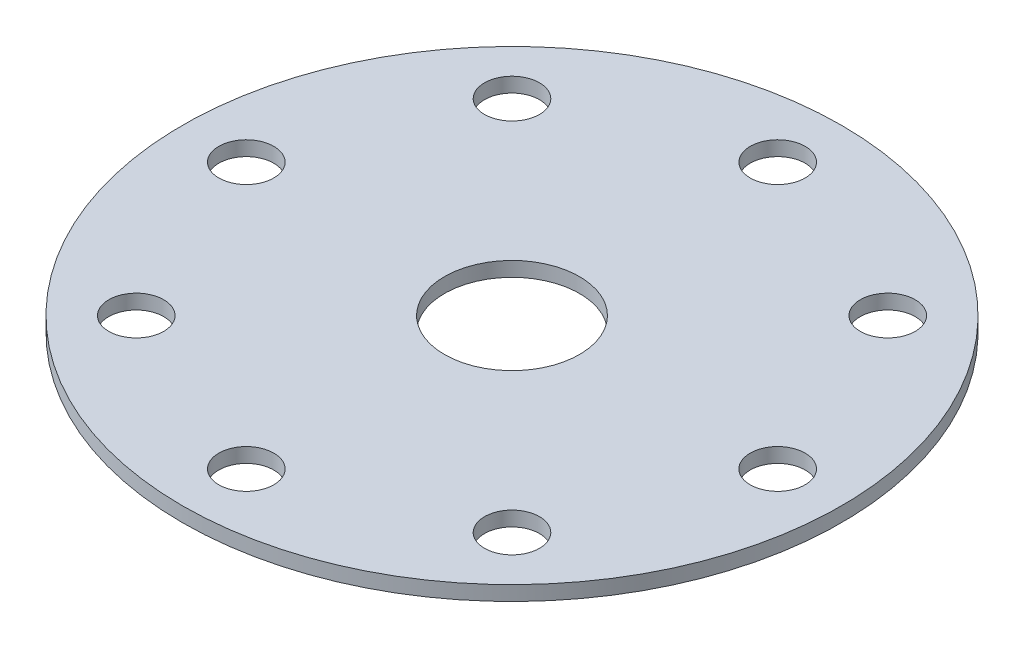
ISO-10303-21;
HEADER;
FILE_DESCRIPTION(('STEP AP214'),'2;1');
FILE_NAME('part.step','',(''),(''),'','','');
FILE_SCHEMA(('AUTOMOTIVE_DESIGN { 1 0 10303 214 1 1 1 1 }'));
ENDSEC;
DATA;
#1=APPLICATION_CONTEXT('core data for automotive mechanical design processes');
#2=APPLICATION_PROTOCOL_DEFINITION('international standard','automotive_design',2000,#1);
#3=PRODUCT_CONTEXT('',#1,'mechanical');
#4=PRODUCT('Part','Part','',(#3));
#5=PRODUCT_RELATED_PRODUCT_CATEGORY('part','',(#4));
#6=PRODUCT_DEFINITION_FORMATION('','',#4);
#7=PRODUCT_DEFINITION_CONTEXT('part definition',#1,'design');
#8=PRODUCT_DEFINITION('design','',#6,#7);
#9=PRODUCT_DEFINITION_SHAPE('','',#8);
#10=(LENGTH_UNIT() NAMED_UNIT(*) SI_UNIT(.MILLI.,.METRE.));
#11=(NAMED_UNIT(*) PLANE_ANGLE_UNIT() SI_UNIT($,.RADIAN.));
#12=(NAMED_UNIT(*) SI_UNIT($,.STERADIAN.) SOLID_ANGLE_UNIT());
#13=UNCERTAINTY_MEASURE_WITH_UNIT(LENGTH_MEASURE(1.E-05),#10,'distance_accuracy_value','');
#14=(GEOMETRIC_REPRESENTATION_CONTEXT(3) GLOBAL_UNCERTAINTY_ASSIGNED_CONTEXT((#13)) GLOBAL_UNIT_ASSIGNED_CONTEXT((#10,
#11,#12)) REPRESENTATION_CONTEXT('',''));
#15=CARTESIAN_POINT('',(0.,0.,0.));
#16=DIRECTION('',(0.,0.,1.));
#17=DIRECTION('',(1.,0.,0.));
#18=AXIS2_PLACEMENT_3D('',#15,#16,#17);
#19=CARTESIAN_POINT('',(0.,2.54,0.));
#20=DIRECTION('',(0.,-1.,0.));
#21=DIRECTION('',(0.,0.,-1.));
#22=AXIS2_PLACEMENT_3D('',#19,#20,#21);
#23=CYLINDRICAL_SURFACE('',#22,57.15);
#24=CARTESIAN_POINT('',(0.,2.54,0.));
#25=DIRECTION('',(0.,1.,0.));
#26=DIRECTION('',(0.,0.,1.));
#27=AXIS2_PLACEMENT_3D('',#24,#25,#26);
#28=CIRCLE('',#27,57.15);
#29=CARTESIAN_POINT('',(0.,2.54,57.15));
#30=VERTEX_POINT('',#29);
#31=EDGE_CURVE('E10',#30,#30,#28,.T.);
#32=ORIENTED_EDGE('',*,*,#31,.F.);
#33=EDGE_LOOP('',(#32));
#34=FACE_BOUND('',#33,.T.);
#35=CARTESIAN_POINT('',(0.,0.,0.));
#36=DIRECTION('',(0.,1.,0.));
#37=DIRECTION('',(0.,0.,1.));
#38=AXIS2_PLACEMENT_3D('',#35,#36,#37);
#39=CIRCLE('',#38,57.15);
#40=CARTESIAN_POINT('',(0.,0.,57.15));
#41=VERTEX_POINT('',#40);
#42=EDGE_CURVE('E42',#41,#41,#39,.T.);
#43=ORIENTED_EDGE('',*,*,#42,.T.);
#44=EDGE_LOOP('',(#43));
#45=FACE_BOUND('',#44,.T.);
#46=ADVANCED_FACE('F39',(#34,#45),#23,.T.);
#47=CARTESIAN_POINT('',(0.,2.54,0.));
#48=DIRECTION('',(0.,1.,0.));
#49=DIRECTION('',(0.,0.,1.));
#50=AXIS2_PLACEMENT_3D('',#47,#48,#49);
#51=PLANE('',#50);
#52=CARTESIAN_POINT('',(0.,2.54,-46.0756));
#53=DIRECTION('',(0.,1.,0.));
#54=DIRECTION('',(0.,0.,1.));
#55=AXIS2_PLACEMENT_3D('',#52,#53,#54);
#56=CIRCLE('',#55,4.7625);
#57=CARTESIAN_POINT('',(0.,2.54,-41.3131));
#58=VERTEX_POINT('',#57);
#59=EDGE_CURVE('E101',#58,#58,#56,.T.);
#60=ORIENTED_EDGE('',*,*,#59,.F.);
#61=EDGE_LOOP('',(#60));
#62=FACE_BOUND('',#61,.T.);
#63=CARTESIAN_POINT('',(32.5803692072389,2.54,-32.5803692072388));
#64=DIRECTION('',(0.,1.,0.));
#65=DIRECTION('',(0.,0.,1.));
#66=AXIS2_PLACEMENT_3D('',#63,#64,#65);
#67=CIRCLE('',#66,4.7625);
#68=CARTESIAN_POINT('',(32.5803692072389,2.54,-27.8178692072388));
#69=VERTEX_POINT('',#68);
#70=EDGE_CURVE('E95',#69,#69,#67,.T.);
#71=ORIENTED_EDGE('',*,*,#70,.F.);
#72=EDGE_LOOP('',(#71));
#73=FACE_BOUND('',#72,.T.);
#74=CARTESIAN_POINT('',(-32.5803692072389,2.54,-32.5803692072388));
#75=DIRECTION('',(0.,1.,0.));
#76=DIRECTION('',(0.,0.,1.));
#77=AXIS2_PLACEMENT_3D('',#74,#75,#76);
#78=CIRCLE('',#77,4.7625);
#79=CARTESIAN_POINT('',(-32.5803692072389,2.54,-27.8178692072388));
#80=VERTEX_POINT('',#79);
#81=EDGE_CURVE('E89',#80,#80,#78,.T.);
#82=ORIENTED_EDGE('',*,*,#81,.F.);
#83=EDGE_LOOP('',(#82));
#84=FACE_BOUND('',#83,.T.);
#85=CARTESIAN_POINT('',(0.,2.54,46.0756));
#86=DIRECTION('',(0.,1.,0.));
#87=DIRECTION('',(0.,0.,1.));
#88=AXIS2_PLACEMENT_3D('',#85,#86,#87);
#89=CIRCLE('',#88,4.7625);
#90=CARTESIAN_POINT('',(0.,2.54,50.8381));
#91=VERTEX_POINT('',#90);
#92=EDGE_CURVE('E83',#91,#91,#89,.T.);
#93=ORIENTED_EDGE('',*,*,#92,.F.);
#94=EDGE_LOOP('',(#93));
#95=FACE_BOUND('',#94,.T.);
#96=CARTESIAN_POINT('',(32.5803692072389,2.54,32.5803692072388));
#97=DIRECTION('',(0.,1.,0.));
#98=DIRECTION('',(0.,0.,1.));
#99=AXIS2_PLACEMENT_3D('',#96,#97,#98);
#100=CIRCLE('',#99,4.7625);
#101=CARTESIAN_POINT('',(32.5803692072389,2.54,37.3428692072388));
#102=VERTEX_POINT('',#101);
#103=EDGE_CURVE('E77',#102,#102,#100,.T.);
#104=ORIENTED_EDGE('',*,*,#103,.F.);
#105=EDGE_LOOP('',(#104));
#106=FACE_BOUND('',#105,.T.);
#107=CARTESIAN_POINT('',(-32.5803692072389,2.54,32.5803692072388));
#108=DIRECTION('',(0.,1.,0.));
#109=DIRECTION('',(0.,0.,1.));
#110=AXIS2_PLACEMENT_3D('',#107,#108,#109);
#111=CIRCLE('',#110,4.7625);
#112=CARTESIAN_POINT('',(-32.5803692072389,2.54,37.3428692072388));
#113=VERTEX_POINT('',#112);
#114=EDGE_CURVE('E71',#113,#113,#111,.T.);
#115=ORIENTED_EDGE('',*,*,#114,.F.);
#116=EDGE_LOOP('',(#115));
#117=FACE_BOUND('',#116,.T.);
#118=CARTESIAN_POINT('',(46.0756,2.54,0.));
#119=DIRECTION('',(0.,1.,0.));
#120=DIRECTION('',(0.,0.,1.));
#121=AXIS2_PLACEMENT_3D('',#118,#119,#120);
#122=CIRCLE('',#121,4.7625);
#123=CARTESIAN_POINT('',(46.0756,2.54,4.7625));
#124=VERTEX_POINT('',#123);
#125=EDGE_CURVE('E65',#124,#124,#122,.T.);
#126=ORIENTED_EDGE('',*,*,#125,.F.);
#127=EDGE_LOOP('',(#126));
#128=FACE_BOUND('',#127,.T.);
#129=CARTESIAN_POINT('',(-46.0756,2.54,0.));
#130=DIRECTION('',(0.,1.,0.));
#131=DIRECTION('',(0.,0.,1.));
#132=AXIS2_PLACEMENT_3D('',#129,#130,#131);
#133=CIRCLE('',#132,4.7625);
#134=CARTESIAN_POINT('',(-46.0756,2.54,4.7625));
#135=VERTEX_POINT('',#134);
#136=EDGE_CURVE('E59',#135,#135,#133,.T.);
#137=ORIENTED_EDGE('',*,*,#136,.F.);
#138=EDGE_LOOP('',(#137));
#139=FACE_BOUND('',#138,.T.);
#140=CARTESIAN_POINT('',(0.,2.54,0.));
#141=DIRECTION('',(0.,1.,0.));
#142=DIRECTION('',(0.,0.,1.));
#143=AXIS2_PLACEMENT_3D('',#140,#141,#142);
#144=CIRCLE('',#143,11.70813);
#145=CARTESIAN_POINT('',(0.,2.54,11.70813));
#146=VERTEX_POINT('',#145);
#147=EDGE_CURVE('E53',#146,#146,#144,.T.);
#148=ORIENTED_EDGE('',*,*,#147,.F.);
#149=EDGE_LOOP('',(#148));
#150=FACE_BOUND('',#149,.T.);
#151=ORIENTED_EDGE('',*,*,#31,.T.);
#152=EDGE_LOOP('',(#151));
#153=FACE_BOUND('',#152,.T.);
#154=ADVANCED_FACE('F107',(#62,#73,#84,#95,#106,#117,#128,#139,#150,#153),#51,.T.);
#155=CARTESIAN_POINT('',(0.,0.,0.));
#156=DIRECTION('',(0.,1.,0.));
#157=DIRECTION('',(0.,0.,1.));
#158=AXIS2_PLACEMENT_3D('',#155,#156,#157);
#159=PLANE('',#158);
#160=CARTESIAN_POINT('',(0.,0.,-46.0756));
#161=DIRECTION('',(0.,1.,0.));
#162=DIRECTION('',(0.,0.,1.));
#163=AXIS2_PLACEMENT_3D('',#160,#161,#162);
#164=CIRCLE('',#163,4.7625);
#165=CARTESIAN_POINT('',(0.,0.,-41.3131));
#166=VERTEX_POINT('',#165);
#167=EDGE_CURVE('E98',#166,#166,#164,.T.);
#168=ORIENTED_EDGE('',*,*,#167,.T.);
#169=EDGE_LOOP('',(#168));
#170=FACE_BOUND('',#169,.T.);
#171=CARTESIAN_POINT('',(32.5803692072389,0.,-32.5803692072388));
#172=DIRECTION('',(0.,1.,0.));
#173=DIRECTION('',(0.,0.,1.));
#174=AXIS2_PLACEMENT_3D('',#171,#172,#173);
#175=CIRCLE('',#174,4.7625);
#176=CARTESIAN_POINT('',(32.5803692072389,0.,-27.8178692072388));
#177=VERTEX_POINT('',#176);
#178=EDGE_CURVE('E92',#177,#177,#175,.T.);
#179=ORIENTED_EDGE('',*,*,#178,.T.);
#180=EDGE_LOOP('',(#179));
#181=FACE_BOUND('',#180,.T.);
#182=CARTESIAN_POINT('',(-32.5803692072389,0.,-32.5803692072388));
#183=DIRECTION('',(0.,1.,0.));
#184=DIRECTION('',(0.,0.,1.));
#185=AXIS2_PLACEMENT_3D('',#182,#183,#184);
#186=CIRCLE('',#185,4.7625);
#187=CARTESIAN_POINT('',(-32.5803692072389,0.,-27.8178692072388));
#188=VERTEX_POINT('',#187);
#189=EDGE_CURVE('E86',#188,#188,#186,.T.);
#190=ORIENTED_EDGE('',*,*,#189,.T.);
#191=EDGE_LOOP('',(#190));
#192=FACE_BOUND('',#191,.T.);
#193=CARTESIAN_POINT('',(0.,0.,46.0756));
#194=DIRECTION('',(0.,1.,0.));
#195=DIRECTION('',(0.,0.,1.));
#196=AXIS2_PLACEMENT_3D('',#193,#194,#195);
#197=CIRCLE('',#196,4.7625);
#198=CARTESIAN_POINT('',(0.,0.,50.8381));
#199=VERTEX_POINT('',#198);
#200=EDGE_CURVE('E80',#199,#199,#197,.T.);
#201=ORIENTED_EDGE('',*,*,#200,.T.);
#202=EDGE_LOOP('',(#201));
#203=FACE_BOUND('',#202,.T.);
#204=CARTESIAN_POINT('',(32.5803692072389,0.,32.5803692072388));
#205=DIRECTION('',(0.,1.,0.));
#206=DIRECTION('',(0.,0.,1.));
#207=AXIS2_PLACEMENT_3D('',#204,#205,#206);
#208=CIRCLE('',#207,4.7625);
#209=CARTESIAN_POINT('',(32.5803692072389,0.,37.3428692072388));
#210=VERTEX_POINT('',#209);
#211=EDGE_CURVE('E74',#210,#210,#208,.T.);
#212=ORIENTED_EDGE('',*,*,#211,.T.);
#213=EDGE_LOOP('',(#212));
#214=FACE_BOUND('',#213,.T.);
#215=CARTESIAN_POINT('',(-32.5803692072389,0.,32.5803692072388));
#216=DIRECTION('',(0.,1.,0.));
#217=DIRECTION('',(0.,0.,1.));
#218=AXIS2_PLACEMENT_3D('',#215,#216,#217);
#219=CIRCLE('',#218,4.7625);
#220=CARTESIAN_POINT('',(-32.5803692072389,0.,37.3428692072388));
#221=VERTEX_POINT('',#220);
#222=EDGE_CURVE('E68',#221,#221,#219,.T.);
#223=ORIENTED_EDGE('',*,*,#222,.T.);
#224=EDGE_LOOP('',(#223));
#225=FACE_BOUND('',#224,.T.);
#226=CARTESIAN_POINT('',(46.0756,0.,0.));
#227=DIRECTION('',(0.,1.,0.));
#228=DIRECTION('',(0.,0.,1.));
#229=AXIS2_PLACEMENT_3D('',#226,#227,#228);
#230=CIRCLE('',#229,4.7625);
#231=CARTESIAN_POINT('',(46.0756,0.,4.7625));
#232=VERTEX_POINT('',#231);
#233=EDGE_CURVE('E62',#232,#232,#230,.T.);
#234=ORIENTED_EDGE('',*,*,#233,.T.);
#235=EDGE_LOOP('',(#234));
#236=FACE_BOUND('',#235,.T.);
#237=CARTESIAN_POINT('',(-46.0756,0.,0.));
#238=DIRECTION('',(0.,1.,0.));
#239=DIRECTION('',(0.,0.,1.));
#240=AXIS2_PLACEMENT_3D('',#237,#238,#239);
#241=CIRCLE('',#240,4.7625);
#242=CARTESIAN_POINT('',(-46.0756,0.,4.7625));
#243=VERTEX_POINT('',#242);
#244=EDGE_CURVE('E56',#243,#243,#241,.T.);
#245=ORIENTED_EDGE('',*,*,#244,.T.);
#246=EDGE_LOOP('',(#245));
#247=FACE_BOUND('',#246,.T.);
#248=CARTESIAN_POINT('',(0.,0.,0.));
#249=DIRECTION('',(0.,1.,0.));
#250=DIRECTION('',(0.,0.,1.));
#251=AXIS2_PLACEMENT_3D('',#248,#249,#250);
#252=CIRCLE('',#251,11.70813);
#253=CARTESIAN_POINT('',(0.,0.,11.70813));
#254=VERTEX_POINT('',#253);
#255=EDGE_CURVE('E49',#254,#254,#252,.T.);
#256=ORIENTED_EDGE('',*,*,#255,.T.);
#257=EDGE_LOOP('',(#256));
#258=FACE_BOUND('',#257,.T.);
#259=ORIENTED_EDGE('',*,*,#42,.F.);
#260=EDGE_LOOP('',(#259));
#261=FACE_BOUND('',#260,.T.);
#262=ADVANCED_FACE('F110',(#170,#181,#192,#203,#214,#225,#236,#247,#258,#261),#159,.F.);
#263=CARTESIAN_POINT('',(0.,2.54,0.));
#264=DIRECTION('',(0.,1.,0.));
#265=DIRECTION('',(0.,0.,1.));
#266=AXIS2_PLACEMENT_3D('',#263,#264,#265);
#267=CYLINDRICAL_SURFACE('',#266,11.70813);
#268=ORIENTED_EDGE('',*,*,#255,.F.);
#269=EDGE_LOOP('',(#268));
#270=FACE_BOUND('',#269,.T.);
#271=ORIENTED_EDGE('',*,*,#147,.T.);
#272=EDGE_LOOP('',(#271));
#273=FACE_BOUND('',#272,.T.);
#274=ADVANCED_FACE('F128',(#270,#273),#267,.F.);
#275=CARTESIAN_POINT('',(-46.0756,2.54,0.));
#276=DIRECTION('',(0.,1.,0.));
#277=DIRECTION('',(0.,0.,1.));
#278=AXIS2_PLACEMENT_3D('',#275,#276,#277);
#279=CYLINDRICAL_SURFACE('',#278,4.7625);
#280=ORIENTED_EDGE('',*,*,#244,.F.);
#281=EDGE_LOOP('',(#280));
#282=FACE_BOUND('',#281,.T.);
#283=ORIENTED_EDGE('',*,*,#136,.T.);
#284=EDGE_LOOP('',(#283));
#285=FACE_BOUND('',#284,.T.);
#286=ADVANCED_FACE('F130',(#282,#285),#279,.F.);
#287=CARTESIAN_POINT('',(46.0756,2.54,0.));
#288=DIRECTION('',(0.,1.,0.));
#289=DIRECTION('',(0.,0.,1.));
#290=AXIS2_PLACEMENT_3D('',#287,#288,#289);
#291=CYLINDRICAL_SURFACE('',#290,4.7625);
#292=ORIENTED_EDGE('',*,*,#233,.F.);
#293=EDGE_LOOP('',(#292));
#294=FACE_BOUND('',#293,.T.);
#295=ORIENTED_EDGE('',*,*,#125,.T.);
#296=EDGE_LOOP('',(#295));
#297=FACE_BOUND('',#296,.T.);
#298=ADVANCED_FACE('F137',(#294,#297),#291,.F.);
#299=CARTESIAN_POINT('',(-32.5803692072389,2.54,32.5803692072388));
#300=DIRECTION('',(0.,1.,0.));
#301=DIRECTION('',(0.,0.,1.));
#302=AXIS2_PLACEMENT_3D('',#299,#300,#301);
#303=CYLINDRICAL_SURFACE('',#302,4.7625);
#304=ORIENTED_EDGE('',*,*,#222,.F.);
#305=EDGE_LOOP('',(#304));
#306=FACE_BOUND('',#305,.T.);
#307=ORIENTED_EDGE('',*,*,#114,.T.);
#308=EDGE_LOOP('',(#307));
#309=FACE_BOUND('',#308,.T.);
#310=ADVANCED_FACE('F177',(#306,#309),#303,.F.);
#311=CARTESIAN_POINT('',(32.5803692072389,2.54,32.5803692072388));
#312=DIRECTION('',(0.,1.,0.));
#313=DIRECTION('',(0.,0.,1.));
#314=AXIS2_PLACEMENT_3D('',#311,#312,#313);
#315=CYLINDRICAL_SURFACE('',#314,4.7625);
#316=ORIENTED_EDGE('',*,*,#211,.F.);
#317=EDGE_LOOP('',(#316));
#318=FACE_BOUND('',#317,.T.);
#319=ORIENTED_EDGE('',*,*,#103,.T.);
#320=EDGE_LOOP('',(#319));
#321=FACE_BOUND('',#320,.T.);
#322=ADVANCED_FACE('F188',(#318,#321),#315,.F.);
#323=CARTESIAN_POINT('',(0.,2.54,46.0756));
#324=DIRECTION('',(0.,1.,0.));
#325=DIRECTION('',(0.,0.,1.));
#326=AXIS2_PLACEMENT_3D('',#323,#324,#325);
#327=CYLINDRICAL_SURFACE('',#326,4.7625);
#328=ORIENTED_EDGE('',*,*,#200,.F.);
#329=EDGE_LOOP('',(#328));
#330=FACE_BOUND('',#329,.T.);
#331=ORIENTED_EDGE('',*,*,#92,.T.);
#332=EDGE_LOOP('',(#331));
#333=FACE_BOUND('',#332,.T.);
#334=ADVANCED_FACE('F199',(#330,#333),#327,.F.);
#335=CARTESIAN_POINT('',(-32.5803692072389,2.54,-32.5803692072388));
#336=DIRECTION('',(0.,1.,0.));
#337=DIRECTION('',(0.,0.,1.));
#338=AXIS2_PLACEMENT_3D('',#335,#336,#337);
#339=CYLINDRICAL_SURFACE('',#338,4.7625);
#340=ORIENTED_EDGE('',*,*,#189,.F.);
#341=EDGE_LOOP('',(#340));
#342=FACE_BOUND('',#341,.T.);
#343=ORIENTED_EDGE('',*,*,#81,.T.);
#344=EDGE_LOOP('',(#343));
#345=FACE_BOUND('',#344,.T.);
#346=ADVANCED_FACE('F210',(#342,#345),#339,.F.);
#347=CARTESIAN_POINT('',(32.5803692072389,2.54,-32.5803692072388));
#348=DIRECTION('',(0.,1.,0.));
#349=DIRECTION('',(0.,0.,1.));
#350=AXIS2_PLACEMENT_3D('',#347,#348,#349);
#351=CYLINDRICAL_SURFACE('',#350,4.7625);
#352=ORIENTED_EDGE('',*,*,#178,.F.);
#353=EDGE_LOOP('',(#352));
#354=FACE_BOUND('',#353,.T.);
#355=ORIENTED_EDGE('',*,*,#70,.T.);
#356=EDGE_LOOP('',(#355));
#357=FACE_BOUND('',#356,.T.);
#358=ADVANCED_FACE('F221',(#354,#357),#351,.F.);
#359=CARTESIAN_POINT('',(0.,2.54,-46.0756));
#360=DIRECTION('',(0.,1.,0.));
#361=DIRECTION('',(0.,0.,1.));
#362=AXIS2_PLACEMENT_3D('',#359,#360,#361);
#363=CYLINDRICAL_SURFACE('',#362,4.7625);
#364=ORIENTED_EDGE('',*,*,#167,.F.);
#365=EDGE_LOOP('',(#364));
#366=FACE_BOUND('',#365,.T.);
#367=ORIENTED_EDGE('',*,*,#59,.T.);
#368=EDGE_LOOP('',(#367));
#369=FACE_BOUND('',#368,.T.);
#370=ADVANCED_FACE('F105',(#366,#369),#363,.F.);
#371=CLOSED_SHELL('',(#46,#154,#262,#274,#286,#298,#310,#322,#334,#346,#358,#370));
#372=MANIFOLD_SOLID_BREP('B2',#371);
#373=ADVANCED_BREP_SHAPE_REPRESENTATION('',(#18,#372),#14);
#374=SHAPE_DEFINITION_REPRESENTATION(#9,#373);
ENDSEC;
END-ISO-10303-21;
